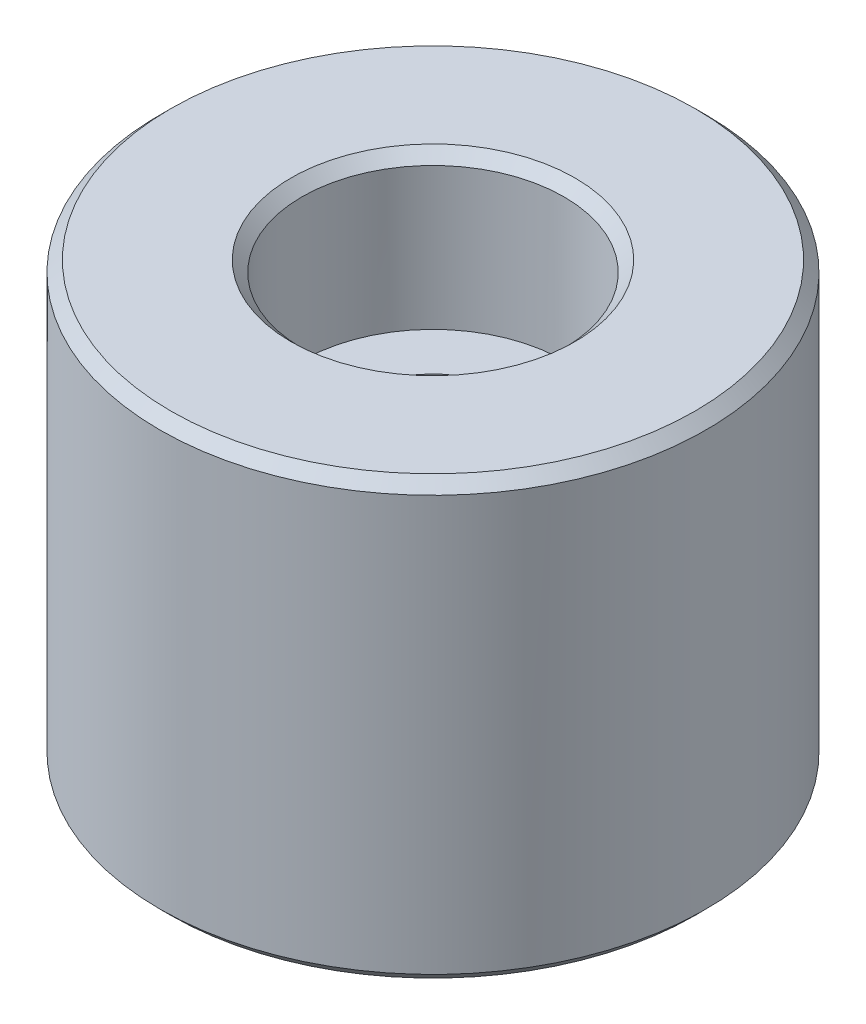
from build123d import *

# Parameters (mm, degrees)
CHANFREIN1_SIZE = 0.5


with BuildPart() as part:
    # Esquisse1 → Base-R_volution (revolve)
    with BuildSketch(Plane.XY, mode=Mode.PRIVATE) as base_r_volution_sk:
        Polygon((12.5, 0), (12.5, 20), (6, 20), (6, 13), (3.5, 13), (3.5, -4), (6, -4), (6, 0), align=None)
    revolve(base_r_volution_sk.sketch.rotate(Axis((0, 50, 0), (0, -1, 0)), 90), axis=Axis((0, 50, 0), (0, -1, 0)))

    # Chanfrein1
    chanfrein1_edges = [part.edges().sort_by_distance(p)[0] for p in [
        (0, -4, -3.5),
        (0, 20, -6),
        (0, 20, -12.5),
        (0, 0, -12.5),
        (0, -4, -6),
    ]]
    chamfer(chanfrein1_edges, length=CHANFREIN1_SIZE)


solid = part.part
